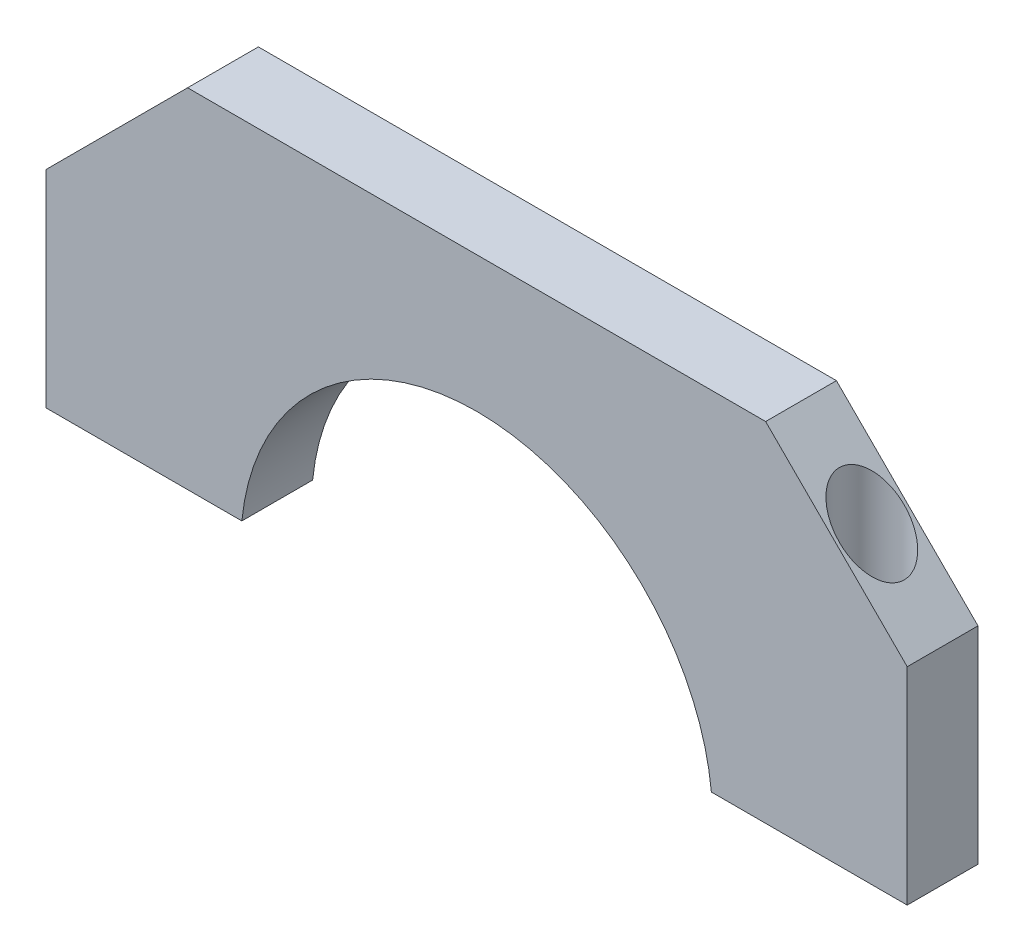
ISO-10303-21;
HEADER;
FILE_DESCRIPTION(('STEP AP214'),'2;1');
FILE_NAME('part.step','',(''),(''),'','','');
FILE_SCHEMA(('AUTOMOTIVE_DESIGN { 1 0 10303 214 1 1 1 1 }'));
ENDSEC;
DATA;
#1=APPLICATION_CONTEXT('core data for automotive mechanical design processes');
#2=APPLICATION_PROTOCOL_DEFINITION('international standard','automotive_design',2000,#1);
#3=PRODUCT_CONTEXT('',#1,'mechanical');
#4=PRODUCT('Part','Part','',(#3));
#5=PRODUCT_RELATED_PRODUCT_CATEGORY('part','',(#4));
#6=PRODUCT_DEFINITION_FORMATION('','',#4);
#7=PRODUCT_DEFINITION_CONTEXT('part definition',#1,'design');
#8=PRODUCT_DEFINITION('design','',#6,#7);
#9=PRODUCT_DEFINITION_SHAPE('','',#8);
#10=(LENGTH_UNIT() NAMED_UNIT(*) SI_UNIT(.MILLI.,.METRE.));
#11=(NAMED_UNIT(*) PLANE_ANGLE_UNIT() SI_UNIT($,.RADIAN.));
#12=(NAMED_UNIT(*) SI_UNIT($,.STERADIAN.) SOLID_ANGLE_UNIT());
#13=UNCERTAINTY_MEASURE_WITH_UNIT(LENGTH_MEASURE(1.E-05),#10,'distance_accuracy_value','');
#14=(GEOMETRIC_REPRESENTATION_CONTEXT(3) GLOBAL_UNCERTAINTY_ASSIGNED_CONTEXT((#13)) GLOBAL_UNIT_ASSIGNED_CONTEXT((#10,
#11,#12)) REPRESENTATION_CONTEXT('',''));
#15=CARTESIAN_POINT('',(0.,0.,0.));
#16=DIRECTION('',(0.,0.,1.));
#17=DIRECTION('',(1.,0.,0.));
#18=AXIS2_PLACEMENT_3D('',#15,#16,#17);
#19=CARTESIAN_POINT('',(-73.,-29.5,12.));
#20=DIRECTION('',(1.,0.,0.));
#21=DIRECTION('',(0.,0.,-1.));
#22=AXIS2_PLACEMENT_3D('',#19,#20,#21);
#23=PLANE('',#22);
#24=DIRECTION('',(0.,-1.,0.));
#25=VECTOR('',#24,1.);
#26=CARTESIAN_POINT('',(-73.,-29.5,0.));
#27=LINE('',#26,#25);
#28=CARTESIAN_POINT('',(-73.,5.49999999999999,0.));
#29=VERTEX_POINT('',#28);
#30=CARTESIAN_POINT('',(-73.,-29.5,0.));
#31=VERTEX_POINT('',#30);
#32=EDGE_CURVE('E148',#29,#31,#27,.T.);
#33=ORIENTED_EDGE('',*,*,#32,.T.);
#34=DIRECTION('',(0.,0.,-1.));
#35=VECTOR('',#34,1.);
#36=CARTESIAN_POINT('',(-73.,-29.5,12.));
#37=LINE('',#36,#35);
#38=CARTESIAN_POINT('',(-73.,-29.5,12.));
#39=VERTEX_POINT('',#38);
#40=EDGE_CURVE('E11',#39,#31,#37,.T.);
#41=ORIENTED_EDGE('',*,*,#40,.F.);
#42=DIRECTION('',(0.,-1.,0.));
#43=VECTOR('',#42,1.);
#44=CARTESIAN_POINT('',(-73.,-29.5,12.));
#45=LINE('',#44,#43);
#46=CARTESIAN_POINT('',(-73.,5.49999999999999,12.));
#47=VERTEX_POINT('',#46);
#48=EDGE_CURVE('E170',#47,#39,#45,.T.);
#49=ORIENTED_EDGE('',*,*,#48,.F.);
#50=DIRECTION('',(0.,0.,-1.));
#51=VECTOR('',#50,1.);
#52=CARTESIAN_POINT('',(-73.,5.49999999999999,12.));
#53=LINE('',#52,#51);
#54=EDGE_CURVE('E144',#47,#29,#53,.T.);
#55=ORIENTED_EDGE('',*,*,#54,.T.);
#56=EDGE_LOOP('',(#33,#41,#49,#55));
#57=FACE_BOUND('',#56,.T.);
#58=ADVANCED_FACE('F45',(#57),#23,.F.);
#59=CARTESIAN_POINT('',(-73.,-29.5,12.));
#60=DIRECTION('',(0.,1.,0.));
#61=DIRECTION('',(-1.,0.,0.));
#62=AXIS2_PLACEMENT_3D('',#59,#60,#61);
#63=PLANE('',#62);
#64=CARTESIAN_POINT('',(-61.,-29.5,6.));
#65=DIRECTION('',(0.,1.,0.));
#66=DIRECTION('',(-1.,0.,0.));
#67=AXIS2_PLACEMENT_3D('',#64,#65,#66);
#68=CIRCLE('',#67,3.25);
#69=CARTESIAN_POINT('',(-64.25,-29.5,6.));
#70=VERTEX_POINT('',#69);
#71=EDGE_CURVE('E422',#70,#70,#68,.F.);
#72=ORIENTED_EDGE('',*,*,#71,.F.);
#73=EDGE_LOOP('',(#72));
#74=FACE_BOUND('',#73,.T.);
#75=DIRECTION('',(1.,0.,0.));
#76=VECTOR('',#75,1.);
#77=CARTESIAN_POINT('',(-73.,-29.5,0.));
#78=LINE('',#77,#76);
#79=CARTESIAN_POINT('',(-39.7994974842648,-29.5,0.));
#80=VERTEX_POINT('',#79);
#81=EDGE_CURVE('E152',#31,#80,#78,.T.);
#82=ORIENTED_EDGE('',*,*,#81,.T.);
#83=DIRECTION('',(0.,0.,-1.));
#84=VECTOR('',#83,1.);
#85=CARTESIAN_POINT('',(-39.7994974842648,-29.5,12.));
#86=LINE('',#85,#84);
#87=CARTESIAN_POINT('',(-39.7994974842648,-29.5,12.));
#88=VERTEX_POINT('',#87);
#89=EDGE_CURVE('E55',#88,#80,#86,.T.);
#90=ORIENTED_EDGE('',*,*,#89,.F.);
#91=DIRECTION('',(1.,0.,0.));
#92=VECTOR('',#91,1.);
#93=CARTESIAN_POINT('',(-73.,-29.5,12.));
#94=LINE('',#93,#92);
#95=EDGE_CURVE('E107',#39,#88,#94,.T.);
#96=ORIENTED_EDGE('',*,*,#95,.F.);
#97=ORIENTED_EDGE('',*,*,#40,.T.);
#98=EDGE_LOOP('',(#82,#90,#96,#97));
#99=FACE_BOUND('',#98,.T.);
#100=ADVANCED_FACE('F247',(#74,#99),#63,.F.);
#101=CARTESIAN_POINT('',(0.,-33.5,12.));
#102=DIRECTION('',(0.,0.,-1.));
#103=DIRECTION('',(-1.,0.,0.));
#104=AXIS2_PLACEMENT_3D('',#101,#102,#103);
#105=CYLINDRICAL_SURFACE('',#104,40.);
#106=CARTESIAN_POINT('',(0.,-33.5,0.));
#107=DIRECTION('',(0.,0.,-1.));
#108=DIRECTION('',(1.,0.,0.));
#109=AXIS2_PLACEMENT_3D('',#106,#107,#108);
#110=CIRCLE('',#109,40.);
#111=CARTESIAN_POINT('',(39.7994974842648,-29.5,0.));
#112=VERTEX_POINT('',#111);
#113=EDGE_CURVE('E155',#80,#112,#110,.T.);
#114=ORIENTED_EDGE('',*,*,#113,.T.);
#115=DIRECTION('',(0.,0.,-1.));
#116=VECTOR('',#115,1.);
#117=CARTESIAN_POINT('',(39.7994974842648,-29.5,12.));
#118=LINE('',#117,#116);
#119=CARTESIAN_POINT('',(39.7994974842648,-29.5,12.));
#120=VERTEX_POINT('',#119);
#121=EDGE_CURVE('E181',#120,#112,#118,.T.);
#122=ORIENTED_EDGE('',*,*,#121,.F.);
#123=CARTESIAN_POINT('',(0.,-33.5,12.));
#124=DIRECTION('',(0.,0.,-1.));
#125=DIRECTION('',(1.,0.,0.));
#126=AXIS2_PLACEMENT_3D('',#123,#124,#125);
#127=CIRCLE('',#126,40.);
#128=EDGE_CURVE('E213',#88,#120,#127,.T.);
#129=ORIENTED_EDGE('',*,*,#128,.F.);
#130=ORIENTED_EDGE('',*,*,#89,.T.);
#131=EDGE_LOOP('',(#114,#122,#129,#130));
#132=FACE_BOUND('',#131,.T.);
#133=ADVANCED_FACE('F251',(#132),#105,.F.);
#134=CARTESIAN_POINT('',(39.7994974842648,-29.5,12.));
#135=DIRECTION('',(0.,1.,0.));
#136=DIRECTION('',(-1.,0.,0.));
#137=AXIS2_PLACEMENT_3D('',#134,#135,#136);
#138=PLANE('',#137);
#139=CARTESIAN_POINT('',(61.,-29.5,6.));
#140=DIRECTION('',(0.,1.,0.));
#141=DIRECTION('',(-1.,0.,0.));
#142=AXIS2_PLACEMENT_3D('',#139,#140,#141);
#143=CIRCLE('',#142,3.25000000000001);
#144=CARTESIAN_POINT('',(57.75,-29.5,6.));
#145=VERTEX_POINT('',#144);
#146=EDGE_CURVE('E203',#145,#145,#143,.F.);
#147=ORIENTED_EDGE('',*,*,#146,.F.);
#148=EDGE_LOOP('',(#147));
#149=FACE_BOUND('',#148,.T.);
#150=DIRECTION('',(1.,0.,0.));
#151=VECTOR('',#150,1.);
#152=CARTESIAN_POINT('',(39.7994974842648,-29.5,0.));
#153=LINE('',#152,#151);
#154=CARTESIAN_POINT('',(73.,-29.5,0.));
#155=VERTEX_POINT('',#154);
#156=EDGE_CURVE('E158',#112,#155,#153,.T.);
#157=ORIENTED_EDGE('',*,*,#156,.T.);
#158=DIRECTION('',(0.,0.,-1.));
#159=VECTOR('',#158,1.);
#160=CARTESIAN_POINT('',(73.,-29.5,12.));
#161=LINE('',#160,#159);
#162=CARTESIAN_POINT('',(73.,-29.5,12.));
#163=VERTEX_POINT('',#162);
#164=EDGE_CURVE('E177',#163,#155,#161,.T.);
#165=ORIENTED_EDGE('',*,*,#164,.F.);
#166=DIRECTION('',(1.,0.,0.));
#167=VECTOR('',#166,1.);
#168=CARTESIAN_POINT('',(39.7994974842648,-29.5,12.));
#169=LINE('',#168,#167);
#170=EDGE_CURVE('E216',#120,#163,#169,.T.);
#171=ORIENTED_EDGE('',*,*,#170,.F.);
#172=ORIENTED_EDGE('',*,*,#121,.T.);
#173=EDGE_LOOP('',(#157,#165,#171,#172));
#174=FACE_BOUND('',#173,.T.);
#175=ADVANCED_FACE('F224',(#149,#174),#138,.F.);
#176=CARTESIAN_POINT('',(73.,-29.5,12.));
#177=DIRECTION('',(-1.,0.,0.));
#178=DIRECTION('',(0.,0.,1.));
#179=AXIS2_PLACEMENT_3D('',#176,#177,#178);
#180=PLANE('',#179);
#181=DIRECTION('',(0.,1.,0.));
#182=VECTOR('',#181,1.);
#183=CARTESIAN_POINT('',(73.,-29.5,0.));
#184=LINE('',#183,#182);
#185=CARTESIAN_POINT('',(73.,5.49999999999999,0.));
#186=VERTEX_POINT('',#185);
#187=EDGE_CURVE('E161',#155,#186,#184,.T.);
#188=ORIENTED_EDGE('',*,*,#187,.T.);
#189=DIRECTION('',(0.,0.,-1.));
#190=VECTOR('',#189,1.);
#191=CARTESIAN_POINT('',(73.,5.49999999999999,12.));
#192=LINE('',#191,#190);
#193=CARTESIAN_POINT('',(73.,5.49999999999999,12.));
#194=VERTEX_POINT('',#193);
#195=EDGE_CURVE('E137',#194,#186,#192,.T.);
#196=ORIENTED_EDGE('',*,*,#195,.F.);
#197=DIRECTION('',(0.,1.,0.));
#198=VECTOR('',#197,1.);
#199=CARTESIAN_POINT('',(73.,-29.5,12.));
#200=LINE('',#199,#198);
#201=EDGE_CURVE('E126',#163,#194,#200,.T.);
#202=ORIENTED_EDGE('',*,*,#201,.F.);
#203=ORIENTED_EDGE('',*,*,#164,.T.);
#204=EDGE_LOOP('',(#188,#196,#202,#203));
#205=FACE_BOUND('',#204,.T.);
#206=ADVANCED_FACE('F228',(#205),#180,.F.);
#207=CARTESIAN_POINT('',(49.,29.5,12.));
#208=DIRECTION('',(-0.707106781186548,-0.707106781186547,0.));
#209=DIRECTION('',(0.707106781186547,-0.707106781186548,0.));
#210=AXIS2_PLACEMENT_3D('',#207,#208,#209);
#211=PLANE('',#210);
#212=CARTESIAN_POINT('',(61.,17.5,6.));
#213=DIRECTION('',(-0.707106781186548,-0.707106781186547,0.));
#214=DIRECTION('',(-0.707106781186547,0.707106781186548,0.));
#215=AXIS2_PLACEMENT_3D('',#212,#213,#214);
#216=ELLIPSE('',#215,7.77817459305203,5.5);
#217=CARTESIAN_POINT('',(55.5,23.,6.));
#218=VERTEX_POINT('',#217);
#219=EDGE_CURVE('E48',#218,#218,#216,.T.);
#220=ORIENTED_EDGE('',*,*,#219,.T.);
#221=EDGE_LOOP('',(#220));
#222=FACE_BOUND('',#221,.T.);
#223=DIRECTION('',(-0.707106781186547,0.707106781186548,0.));
#224=VECTOR('',#223,1.);
#225=CARTESIAN_POINT('',(49.,29.5,0.));
#226=LINE('',#225,#224);
#227=CARTESIAN_POINT('',(49.,29.5,0.));
#228=VERTEX_POINT('',#227);
#229=EDGE_CURVE('E135',#186,#228,#226,.T.);
#230=ORIENTED_EDGE('',*,*,#229,.T.);
#231=DIRECTION('',(0.,0.,-1.));
#232=VECTOR('',#231,1.);
#233=CARTESIAN_POINT('',(49.,29.5,12.));
#234=LINE('',#233,#232);
#235=CARTESIAN_POINT('',(49.,29.5,12.));
#236=VERTEX_POINT('',#235);
#237=EDGE_CURVE('E132',#236,#228,#234,.T.);
#238=ORIENTED_EDGE('',*,*,#237,.F.);
#239=DIRECTION('',(-0.707106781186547,0.707106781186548,0.));
#240=VECTOR('',#239,1.);
#241=CARTESIAN_POINT('',(49.,29.5,12.));
#242=LINE('',#241,#240);
#243=EDGE_CURVE('E120',#194,#236,#242,.T.);
#244=ORIENTED_EDGE('',*,*,#243,.F.);
#245=ORIENTED_EDGE('',*,*,#195,.T.);
#246=EDGE_LOOP('',(#230,#238,#244,#245));
#247=FACE_BOUND('',#246,.T.);
#248=ADVANCED_FACE('F133',(#222,#247),#211,.F.);
#249=CARTESIAN_POINT('',(-49.,29.5,12.));
#250=DIRECTION('',(0.,-1.,0.));
#251=DIRECTION('',(0.,0.,-1.));
#252=AXIS2_PLACEMENT_3D('',#249,#250,#251);
#253=PLANE('',#252);
#254=DIRECTION('',(-1.,0.,0.));
#255=VECTOR('',#254,1.);
#256=CARTESIAN_POINT('',(-49.,29.5,0.));
#257=LINE('',#256,#255);
#258=CARTESIAN_POINT('',(-49.,29.5,0.));
#259=VERTEX_POINT('',#258);
#260=EDGE_CURVE('E93',#228,#259,#257,.T.);
#261=ORIENTED_EDGE('',*,*,#260,.T.);
#262=DIRECTION('',(0.,0.,-1.));
#263=VECTOR('',#262,1.);
#264=CARTESIAN_POINT('',(-49.,29.5,12.));
#265=LINE('',#264,#263);
#266=CARTESIAN_POINT('',(-49.,29.5,12.));
#267=VERTEX_POINT('',#266);
#268=EDGE_CURVE('E138',#267,#259,#265,.T.);
#269=ORIENTED_EDGE('',*,*,#268,.F.);
#270=DIRECTION('',(-1.,0.,0.));
#271=VECTOR('',#270,1.);
#272=CARTESIAN_POINT('',(-49.,29.5,12.));
#273=LINE('',#272,#271);
#274=EDGE_CURVE('E124',#236,#267,#273,.T.);
#275=ORIENTED_EDGE('',*,*,#274,.F.);
#276=ORIENTED_EDGE('',*,*,#237,.T.);
#277=EDGE_LOOP('',(#261,#269,#275,#276));
#278=FACE_BOUND('',#277,.T.);
#279=ADVANCED_FACE('F140',(#278),#253,.F.);
#280=CARTESIAN_POINT('',(-73.,5.49999999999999,12.));
#281=DIRECTION('',(0.707106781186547,-0.707106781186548,0.));
#282=DIRECTION('',(0.707106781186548,0.707106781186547,0.));
#283=AXIS2_PLACEMENT_3D('',#280,#281,#282);
#284=PLANE('',#283);
#285=CARTESIAN_POINT('',(-61.,17.5,6.));
#286=DIRECTION('',(0.707106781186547,-0.707106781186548,0.));
#287=DIRECTION('',(0.707106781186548,0.707106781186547,0.));
#288=AXIS2_PLACEMENT_3D('',#285,#286,#287);
#289=ELLIPSE('',#288,7.77817459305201,5.5);
#290=CARTESIAN_POINT('',(-55.5,23.,6.));
#291=VERTEX_POINT('',#290);
#292=EDGE_CURVE('E187',#291,#291,#289,.T.);
#293=ORIENTED_EDGE('',*,*,#292,.T.);
#294=EDGE_LOOP('',(#293));
#295=FACE_BOUND('',#294,.T.);
#296=DIRECTION('',(-0.707106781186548,-0.707106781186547,0.));
#297=VECTOR('',#296,1.);
#298=CARTESIAN_POINT('',(-73.,5.49999999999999,0.));
#299=LINE('',#298,#297);
#300=EDGE_CURVE('E99',#259,#29,#299,.T.);
#301=ORIENTED_EDGE('',*,*,#300,.T.);
#302=ORIENTED_EDGE('',*,*,#54,.F.);
#303=DIRECTION('',(-0.707106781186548,-0.707106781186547,0.));
#304=VECTOR('',#303,1.);
#305=CARTESIAN_POINT('',(-73.,5.49999999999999,12.));
#306=LINE('',#305,#304);
#307=EDGE_CURVE('E64',#267,#47,#306,.T.);
#308=ORIENTED_EDGE('',*,*,#307,.F.);
#309=ORIENTED_EDGE('',*,*,#268,.T.);
#310=EDGE_LOOP('',(#301,#302,#308,#309));
#311=FACE_BOUND('',#310,.T.);
#312=ADVANCED_FACE('F236',(#295,#311),#284,.F.);
#313=CARTESIAN_POINT('',(0.,-33.5,12.));
#314=DIRECTION('',(0.,0.,1.));
#315=DIRECTION('',(1.,0.,0.));
#316=AXIS2_PLACEMENT_3D('',#313,#314,#315);
#317=PLANE('',#316);
#318=ORIENTED_EDGE('',*,*,#48,.T.);
#319=ORIENTED_EDGE('',*,*,#95,.T.);
#320=ORIENTED_EDGE('',*,*,#128,.T.);
#321=ORIENTED_EDGE('',*,*,#170,.T.);
#322=ORIENTED_EDGE('',*,*,#201,.T.);
#323=ORIENTED_EDGE('',*,*,#243,.T.);
#324=ORIENTED_EDGE('',*,*,#274,.T.);
#325=ORIENTED_EDGE('',*,*,#307,.T.);
#326=EDGE_LOOP('',(#318,#319,#320,#321,#322,#323,#324,#325));
#327=FACE_BOUND('',#326,.T.);
#328=ADVANCED_FACE('F122',(#327),#317,.T.);
#329=CARTESIAN_POINT('',(0.,-33.5,0.));
#330=DIRECTION('',(0.,0.,1.));
#331=DIRECTION('',(1.,0.,0.));
#332=AXIS2_PLACEMENT_3D('',#329,#330,#331);
#333=PLANE('',#332);
#334=ORIENTED_EDGE('',*,*,#32,.F.);
#335=ORIENTED_EDGE('',*,*,#300,.F.);
#336=ORIENTED_EDGE('',*,*,#260,.F.);
#337=ORIENTED_EDGE('',*,*,#229,.F.);
#338=ORIENTED_EDGE('',*,*,#187,.F.);
#339=ORIENTED_EDGE('',*,*,#156,.F.);
#340=ORIENTED_EDGE('',*,*,#113,.F.);
#341=ORIENTED_EDGE('',*,*,#81,.F.);
#342=EDGE_LOOP('',(#334,#335,#336,#337,#338,#339,#340,#341));
#343=FACE_BOUND('',#342,.T.);
#344=ADVANCED_FACE('F231',(#343),#333,.F.);
#345=CARTESIAN_POINT('',(-61.,-9.50000000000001,6.));
#346=DIRECTION('',(0.,1.,0.));
#347=DIRECTION('',(0.,0.,1.));
#348=AXIS2_PLACEMENT_3D('',#345,#346,#347);
#349=CYLINDRICAL_SURFACE('',#348,5.5);
#350=CARTESIAN_POINT('',(-61.,-9.50000000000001,6.));
#351=DIRECTION('',(0.,1.,0.));
#352=DIRECTION('',(0.,0.,1.));
#353=AXIS2_PLACEMENT_3D('',#350,#351,#352);
#354=CIRCLE('',#353,5.5);
#355=CARTESIAN_POINT('',(-61.,-9.50000000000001,11.5));
#356=VERTEX_POINT('',#355);
#357=EDGE_CURVE('E190',#356,#356,#354,.T.);
#358=ORIENTED_EDGE('',*,*,#357,.F.);
#359=EDGE_LOOP('',(#358));
#360=FACE_BOUND('',#359,.T.);
#361=ORIENTED_EDGE('',*,*,#292,.F.);
#362=EDGE_LOOP('',(#361));
#363=FACE_BOUND('',#362,.T.);
#364=ADVANCED_FACE('F284',(#360,#363),#349,.F.);
#365=CARTESIAN_POINT('',(-61.,-9.50000000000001,6.));
#366=DIRECTION('',(0.,1.,0.));
#367=DIRECTION('',(0.,0.,1.));
#368=AXIS2_PLACEMENT_3D('',#365,#366,#367);
#369=PLANE('',#368);
#370=CARTESIAN_POINT('',(-61.,-9.50000000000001,6.));
#371=DIRECTION('',(0.,1.,0.));
#372=DIRECTION('',(0.,0.,1.));
#373=AXIS2_PLACEMENT_3D('',#370,#371,#372);
#374=CIRCLE('',#373,3.25);
#375=CARTESIAN_POINT('',(-61.,-9.50000000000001,9.25));
#376=VERTEX_POINT('',#375);
#377=EDGE_CURVE('E206',#376,#376,#374,.T.);
#378=ORIENTED_EDGE('',*,*,#377,.F.);
#379=EDGE_LOOP('',(#378));
#380=FACE_BOUND('',#379,.T.);
#381=ORIENTED_EDGE('',*,*,#357,.T.);
#382=EDGE_LOOP('',(#381));
#383=FACE_BOUND('',#382,.T.);
#384=ADVANCED_FACE('F274',(#380,#383),#369,.T.);
#385=CARTESIAN_POINT('',(61.,-9.50000000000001,6.));
#386=DIRECTION('',(0.,1.,0.));
#387=DIRECTION('',(0.,0.,1.));
#388=AXIS2_PLACEMENT_3D('',#385,#386,#387);
#389=CYLINDRICAL_SURFACE('',#388,5.5);
#390=CARTESIAN_POINT('',(61.,-9.50000000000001,6.));
#391=DIRECTION('',(0.,1.,0.));
#392=DIRECTION('',(0.,0.,1.));
#393=AXIS2_PLACEMENT_3D('',#390,#391,#392);
#394=CIRCLE('',#393,5.5);
#395=CARTESIAN_POINT('',(61.,-9.50000000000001,11.5));
#396=VERTEX_POINT('',#395);
#397=EDGE_CURVE('E197',#396,#396,#394,.T.);
#398=ORIENTED_EDGE('',*,*,#397,.F.);
#399=EDGE_LOOP('',(#398));
#400=FACE_BOUND('',#399,.T.);
#401=ORIENTED_EDGE('',*,*,#219,.F.);
#402=EDGE_LOOP('',(#401));
#403=FACE_BOUND('',#402,.T.);
#404=ADVANCED_FACE('F271',(#400,#403),#389,.F.);
#405=CARTESIAN_POINT('',(61.,-9.50000000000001,6.));
#406=DIRECTION('',(0.,1.,0.));
#407=DIRECTION('',(0.,0.,1.));
#408=AXIS2_PLACEMENT_3D('',#405,#406,#407);
#409=PLANE('',#408);
#410=CARTESIAN_POINT('',(61.,-9.50000000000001,6.));
#411=DIRECTION('',(0.,1.,0.));
#412=DIRECTION('',(0.,0.,1.));
#413=AXIS2_PLACEMENT_3D('',#410,#411,#412);
#414=CIRCLE('',#413,3.25000000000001);
#415=CARTESIAN_POINT('',(61.,-9.50000000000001,9.25000000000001));
#416=VERTEX_POINT('',#415);
#417=EDGE_CURVE('E425',#416,#416,#414,.T.);
#418=ORIENTED_EDGE('',*,*,#417,.F.);
#419=EDGE_LOOP('',(#418));
#420=FACE_BOUND('',#419,.T.);
#421=ORIENTED_EDGE('',*,*,#397,.T.);
#422=EDGE_LOOP('',(#421));
#423=FACE_BOUND('',#422,.T.);
#424=ADVANCED_FACE('F273',(#420,#423),#409,.T.);
#425=CARTESIAN_POINT('',(61.,-29.501,6.));
#426=DIRECTION('',(0.,1.,0.));
#427=DIRECTION('',(0.,0.,1.));
#428=AXIS2_PLACEMENT_3D('',#425,#426,#427);
#429=CYLINDRICAL_SURFACE('',#428,3.25000000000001);
#430=ORIENTED_EDGE('',*,*,#417,.T.);
#431=EDGE_LOOP('',(#430));
#432=FACE_BOUND('',#431,.T.);
#433=ORIENTED_EDGE('',*,*,#146,.T.);
#434=EDGE_LOOP('',(#433));
#435=FACE_BOUND('',#434,.T.);
#436=ADVANCED_FACE('F281',(#432,#435),#429,.F.);
#437=CARTESIAN_POINT('',(-61.,-29.501,6.));
#438=DIRECTION('',(0.,1.,0.));
#439=DIRECTION('',(0.,0.,1.));
#440=AXIS2_PLACEMENT_3D('',#437,#438,#439);
#441=CYLINDRICAL_SURFACE('',#440,3.25);
#442=ORIENTED_EDGE('',*,*,#377,.T.);
#443=EDGE_LOOP('',(#442));
#444=FACE_BOUND('',#443,.T.);
#445=ORIENTED_EDGE('',*,*,#71,.T.);
#446=EDGE_LOOP('',(#445));
#447=FACE_BOUND('',#446,.T.);
#448=ADVANCED_FACE('F322',(#444,#447),#441,.F.);
#449=CLOSED_SHELL('',(#58,#100,#133,#175,#206,#248,#279,#312,#328,#344,#364,#384,#404,#424,#436,#448));
#450=MANIFOLD_SOLID_BREP('B2',#449);
#451=ADVANCED_BREP_SHAPE_REPRESENTATION('',(#18,#450),#14);
#452=SHAPE_DEFINITION_REPRESENTATION(#9,#451);
ENDSEC;
END-ISO-10303-21;
